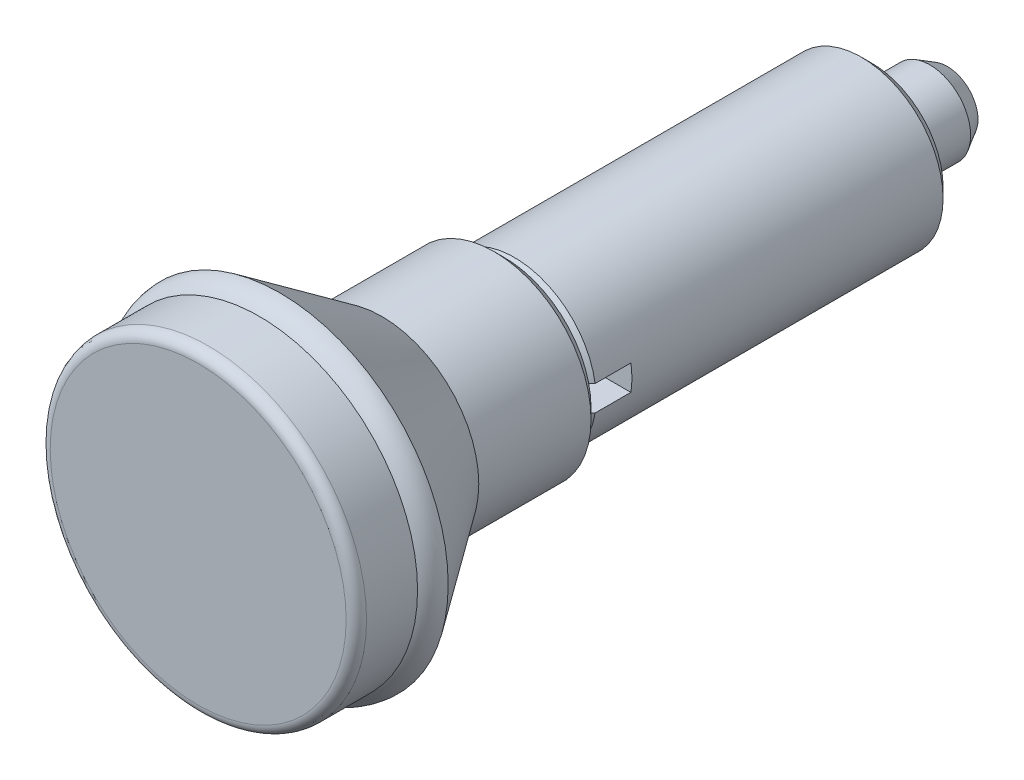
ISO-10303-21;
HEADER;
FILE_DESCRIPTION(('STEP AP214'),'2;1');
FILE_NAME('part.step','',(''),(''),'','','');
FILE_SCHEMA(('AUTOMOTIVE_DESIGN { 1 0 10303 214 1 1 1 1 }'));
ENDSEC;
DATA;
#1=APPLICATION_CONTEXT('core data for automotive mechanical design processes');
#2=APPLICATION_PROTOCOL_DEFINITION('international standard','automotive_design',2000,#1);
#3=PRODUCT_CONTEXT('',#1,'mechanical');
#4=PRODUCT('Part','Part','',(#3));
#5=PRODUCT_RELATED_PRODUCT_CATEGORY('part','',(#4));
#6=PRODUCT_DEFINITION_FORMATION('','',#4);
#7=PRODUCT_DEFINITION_CONTEXT('part definition',#1,'design');
#8=PRODUCT_DEFINITION('design','',#6,#7);
#9=PRODUCT_DEFINITION_SHAPE('','',#8);
#10=(LENGTH_UNIT() NAMED_UNIT(*) SI_UNIT(.MILLI.,.METRE.));
#11=(NAMED_UNIT(*) PLANE_ANGLE_UNIT() SI_UNIT($,.RADIAN.));
#12=(NAMED_UNIT(*) SI_UNIT($,.STERADIAN.) SOLID_ANGLE_UNIT());
#13=UNCERTAINTY_MEASURE_WITH_UNIT(LENGTH_MEASURE(1.E-05),#10,'distance_accuracy_value','');
#14=(GEOMETRIC_REPRESENTATION_CONTEXT(3) GLOBAL_UNCERTAINTY_ASSIGNED_CONTEXT((#13)) GLOBAL_UNIT_ASSIGNED_CONTEXT((#10,
#11,#12)) REPRESENTATION_CONTEXT('',''));
#15=CARTESIAN_POINT('',(0.,0.,0.));
#16=DIRECTION('',(0.,0.,1.));
#17=DIRECTION('',(1.,0.,0.));
#18=AXIS2_PLACEMENT_3D('',#15,#16,#17);
#19=CARTESIAN_POINT('',(0.,0.,36.));
#20=DIRECTION('',(0.,0.,-1.));
#21=DIRECTION('',(-1.,0.,0.));
#22=AXIS2_PLACEMENT_3D('',#19,#20,#21);
#23=CONICAL_SURFACE('',#22,6.99999999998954,0.785398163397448);
#24=CARTESIAN_POINT('',(0.,0.,36.));
#25=DIRECTION('',(0.,0.,1.));
#26=DIRECTION('',(1.,0.,0.));
#27=AXIS2_PLACEMENT_3D('',#24,#25,#26);
#28=CIRCLE('',#27,6.99999999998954);
#29=CARTESIAN_POINT('',(6.88748865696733,1.25,36.));
#30=VERTEX_POINT('',#29);
#31=CARTESIAN_POINT('',(-6.88748865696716,1.25,36.));
#32=VERTEX_POINT('',#31);
#33=EDGE_CURVE('E241',#30,#32,#28,.T.);
#34=ORIENTED_EDGE('',*,*,#33,.F.);
#35=CARTESIAN_POINT('',(3.07331867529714,1.25,39.682201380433));
#36=CARTESIAN_POINT('',(3.19215184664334,1.25,39.5720971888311));
#37=CARTESIAN_POINT('',(3.31056002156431,1.25,39.4615369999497));
#38=CARTESIAN_POINT('',(3.54669771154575,1.25,39.2396971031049));
#39=CARTESIAN_POINT('',(3.66442723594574,1.25,39.1284174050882));
#40=CARTESIAN_POINT('',(3.89937834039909,1.25,38.9053316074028));
#41=CARTESIAN_POINT('',(4.01659993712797,1.25,38.7935255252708));
#42=CARTESIAN_POINT('',(4.2506463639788,1.25,38.5694980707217));
#43=CARTESIAN_POINT('',(4.36747119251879,1.25,38.4572766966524));
#44=CARTESIAN_POINT('',(4.71746563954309,1.25,38.1201402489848));
#45=CARTESIAN_POINT('',(4.95016821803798,1.25,37.8947404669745));
#46=CARTESIAN_POINT('',(5.41475719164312,1.25,37.4430984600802));
#47=CARTESIAN_POINT('',(5.64664357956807,1.25,37.2168562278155));
#48=CARTESIAN_POINT('',(6.01467226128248,1.25,36.8568750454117));
#49=CARTESIAN_POINT('',(6.15100183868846,1.25,36.7233274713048));
#50=CARTESIAN_POINT('',(6.42349568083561,1.25,36.4560645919));
#51=CARTESIAN_POINT('',(6.5596599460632,1.25,36.3223492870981));
#52=CARTESIAN_POINT('',(6.96795284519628,1.25,35.9209914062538));
#53=CARTESIAN_POINT('',(7.23987726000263,1.25,35.6531410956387));
#54=CARTESIAN_POINT('',(7.87810226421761,1.25,35.0235739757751));
#55=CARTESIAN_POINT('',(8.24424504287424,1.25,34.6616972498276));
#56=CARTESIAN_POINT('',(8.97606193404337,1.25,33.9374702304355));
#57=CARTESIAN_POINT('',(9.34173604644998,1.25,33.5751199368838));
#58=CARTESIAN_POINT('',(10.0727396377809,1.25,32.8501037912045));
#59=CARTESIAN_POINT('',(10.4380691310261,1.25,32.4874379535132));
#60=CARTESIAN_POINT('',(11.1684822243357,1.25,31.7618594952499));
#61=CARTESIAN_POINT('',(11.533565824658,1.25,31.3989468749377));
#62=CARTESIAN_POINT('',(11.8985682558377,1.25,31.0359527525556));
#63=B_SPLINE_CURVE_WITH_KNOTS('',3,(#35,#36,#37,#38,#39,#40,#41,#42,#43,#44,#45,#46,#47,#48,#49,
#50,#51,#52,#53,#54,#55,#56,#57,#58,#59,#60,#61,#62),.UNSPECIFIED.,.F.,.F.,(4,2,2,2,2,2,2,2,2,2,
2,2,2,4),(0.,0.485998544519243,0.97199038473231,1.45796614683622,1.94394384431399,
2.91584538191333,3.88775545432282,4.46028161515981,5.03280608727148,6.17787317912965,
7.7222616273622,9.26665042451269,10.810971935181,12.3552918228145),.UNSPECIFIED.);
#64=CARTESIAN_POINT('',(7.9017403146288,1.25,35.));
#65=VERTEX_POINT('',#64);
#66=EDGE_CURVE('E151',#30,#65,#63,.T.);
#67=ORIENTED_EDGE('',*,*,#66,.T.);
#68=CARTESIAN_POINT('',(0.,0.,35.));
#69=DIRECTION('',(0.,0.,1.));
#70=DIRECTION('',(1.,0.,0.));
#71=AXIS2_PLACEMENT_3D('',#68,#69,#70);
#72=CIRCLE('',#71,7.99999999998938);
#73=CARTESIAN_POINT('',(-7.9017403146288,1.25,35.));
#74=VERTEX_POINT('',#73);
#75=EDGE_CURVE('E249',#65,#74,#72,.T.);
#76=ORIENTED_EDGE('',*,*,#75,.T.);
#77=CARTESIAN_POINT('',(-11.5196395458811,1.25,31.4127399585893));
#78=CARTESIAN_POINT('',(-11.1545497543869,1.25,31.7756867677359));
#79=CARTESIAN_POINT('',(-10.7893712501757,1.25,32.1385444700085));
#80=CARTESIAN_POINT('',(-10.0587444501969,1.25,32.863981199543));
#81=CARTESIAN_POINT('',(-9.69329615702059,1.25,33.226560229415));
#82=CARTESIAN_POINT('',(-8.9620504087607,1.25,33.9513263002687));
#83=CARTESIAN_POINT('',(-8.59625297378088,1.25,34.3135133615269));
#84=CARTESIAN_POINT('',(-7.86411782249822,1.25,35.0373483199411));
#85=CARTESIAN_POINT('',(-7.4977801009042,1.25,35.3989962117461));
#86=CARTESIAN_POINT('',(-6.764263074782,1.25,36.1215053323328));
#87=CARTESIAN_POINT('',(-6.39708369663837,1.25,36.4823664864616));
#88=CARTESIAN_POINT('',(-5.84532051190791,1.25,37.0226340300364));
#89=CARTESIAN_POINT('',(-5.66123606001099,1.25,37.2025502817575));
#90=CARTESIAN_POINT('',(-5.2926204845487,1.25,37.5619268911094));
#91=CARTESIAN_POINT('',(-5.10808935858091,1.25,37.7413872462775));
#92=CARTESIAN_POINT('',(-4.73840665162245,1.25,38.0997012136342));
#93=CARTESIAN_POINT('',(-4.55325501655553,1.25,38.2785547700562));
#94=CARTESIAN_POINT('',(-4.18210822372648,1.25,38.6353805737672));
#95=CARTESIAN_POINT('',(-3.99611307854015,1.25,38.8133528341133));
#96=CARTESIAN_POINT('',(-3.71617558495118,1.25,39.0793337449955));
#97=CARTESIAN_POINT('',(-3.6227014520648,1.25,39.1678350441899));
#98=CARTESIAN_POINT('',(-3.43536325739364,1.25,39.3444231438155));
#99=CARTESIAN_POINT('',(-3.3414991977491,1.25,39.4325099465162));
#100=CARTESIAN_POINT('',(-3.15328039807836,1.25,39.6081681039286));
#101=CARTESIAN_POINT('',(-3.05892563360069,1.25,39.695739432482));
#102=CARTESIAN_POINT('',(-2.86958085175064,1.25,39.8701958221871));
#103=CARTESIAN_POINT('',(-2.77459082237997,1.25,39.9570808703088));
#104=CARTESIAN_POINT('',(-2.679210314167,1.25,40.043537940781));
#105=B_SPLINE_CURVE_WITH_KNOTS('',3,(#77,#78,#79,#80,#81,#82,#83,#84,#85,#86,#87,#88,#89,#90,
#91,#92,#93,#94,#95,#96,#97,#98,#99,#100,#101,#102,#103,#104),.UNSPECIFIED.,.F.,.F.,(4,2,2,2,2,
2,2,2,2,2,2,2,2,4),(0.,1.54440566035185,3.08879667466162,4.63310356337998,6.17742567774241,
7.72188845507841,8.49410063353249,9.26631697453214,10.0386024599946,10.8108764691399,
11.1970477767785,11.5832169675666,11.9694055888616,12.3556015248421),.UNSPECIFIED.);
#106=EDGE_CURVE('E178',#74,#32,#105,.T.);
#107=ORIENTED_EDGE('',*,*,#106,.T.);
#108=EDGE_LOOP('',(#34,#67,#76,#107));
#109=FACE_BOUND('',#108,.T.);
#110=ADVANCED_FACE('F14',(#109),#23,.T.);
#111=CARTESIAN_POINT('',(-7.9017403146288,-1.25,35.));
#112=VERTEX_POINT('',#111);
#113=CARTESIAN_POINT('',(7.9017403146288,-1.25,35.));
#114=VERTEX_POINT('',#113);
#115=EDGE_CURVE('E245',#112,#114,#72,.T.);
#116=ORIENTED_EDGE('',*,*,#115,.T.);
#117=CARTESIAN_POINT('',(11.8985682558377,-1.25,31.0359527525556));
#118=CARTESIAN_POINT('',(11.5335502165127,-1.25,31.3989626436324));
#119=CARTESIAN_POINT('',(11.1684508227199,-1.25,31.7618908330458));
#120=CARTESIAN_POINT('',(10.4380084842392,-1.25,32.4874980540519));
#121=CARTESIAN_POINT('',(10.072665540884,-1.25,32.8501770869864));
#122=CARTESIAN_POINT('',(9.34166442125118,-1.25,33.5751911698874));
#123=CARTESIAN_POINT('',(8.97600625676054,-1.25,33.9375262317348));
#124=CARTESIAN_POINT('',(8.24421765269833,-1.25,34.6617234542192));
#125=CARTESIAN_POINT('',(7.87808721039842,-1.25,35.0235856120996));
#126=CARTESIAN_POINT('',(7.14510976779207,-1.25,35.7466262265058));
#127=CARTESIAN_POINT('',(6.77826272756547,-1.25,36.107804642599));
#128=CARTESIAN_POINT('',(6.22715843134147,-1.25,36.6487177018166));
#129=CARTESIAN_POINT('',(6.0433193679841,-1.25,36.8288783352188));
#130=CARTESIAN_POINT('',(5.67527392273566,-1.25,37.1888251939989));
#131=CARTESIAN_POINT('',(5.49106753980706,-1.25,37.3686114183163));
#132=CARTESIAN_POINT('',(5.12215804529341,-1.25,37.7276939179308));
#133=CARTESIAN_POINT('',(4.93745490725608,-1.25,37.906990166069));
#134=CARTESIAN_POINT('',(4.56738195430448,-1.25,38.26489079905));
#135=CARTESIAN_POINT('',(4.3820121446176,-1.25,38.4434951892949));
#136=CARTESIAN_POINT('',(4.01031623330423,-1.25,38.7997259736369));
#137=CARTESIAN_POINT('',(3.82399008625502,-1.25,38.9773523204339));
#138=CARTESIAN_POINT('',(3.54343589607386,-1.25,39.2426713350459));
#139=CARTESIAN_POINT('',(3.449739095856,-1.25,39.3309254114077));
#140=CARTESIAN_POINT('',(3.26189270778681,-1.25,39.5069518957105));
#141=CARTESIAN_POINT('',(3.16774311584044,-1.25,39.5947242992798));
#142=CARTESIAN_POINT('',(3.07331867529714,-1.25,39.682201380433));
#143=B_SPLINE_CURVE_WITH_KNOTS('',3,(#117,#118,#119,#120,#121,#122,#123,#124,#125,#126,#127,
#128,#129,#130,#131,#132,#133,#134,#135,#136,#137,#138,#139,#140,#141,#142),.UNSPECIFIED.,.F.,
.F.,(4,2,2,2,2,2,2,2,2,2,2,2,4),(0.,1.54438642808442,3.08876447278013,4.63308707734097,
6.17741864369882,7.72183884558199,8.4940378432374,9.26623902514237,10.0384821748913,
10.8107192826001,11.5829934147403,11.9691406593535,12.3552914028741),.UNSPECIFIED.);
#144=CARTESIAN_POINT('',(6.88748865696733,-1.25,36.));
#145=VERTEX_POINT('',#144);
#146=EDGE_CURVE('E126',#114,#145,#143,.T.);
#147=ORIENTED_EDGE('',*,*,#146,.T.);
#148=CARTESIAN_POINT('',(-6.88748865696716,-1.25,36.));
#149=VERTEX_POINT('',#148);
#150=EDGE_CURVE('E99',#149,#145,#28,.T.);
#151=ORIENTED_EDGE('',*,*,#150,.F.);
#152=CARTESIAN_POINT('',(-2.679210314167,-1.25,40.043537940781));
#153=CARTESIAN_POINT('',(-2.7861810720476,-1.25,39.9465667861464));
#154=CARTESIAN_POINT('',(-2.89266590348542,-1.25,39.8490636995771));
#155=CARTESIAN_POINT('',(-3.10485922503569,-1.25,39.6532207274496));
#156=CARTESIAN_POINT('',(-3.21056773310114,-1.25,39.5548808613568));
#157=CARTESIAN_POINT('',(-3.4214029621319,-1.25,39.3575923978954));
#158=CARTESIAN_POINT('',(-3.52652971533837,-1.25,39.2586438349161));
#159=CARTESIAN_POINT('',(-3.7363303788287,-1.25,39.0602666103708));
#160=CARTESIAN_POINT('',(-3.8410042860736,-1.25,38.9608379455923));
#161=CARTESIAN_POINT('',(-4.15447359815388,-1.25,38.662011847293));
#162=CARTESIAN_POINT('',(-4.36273628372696,-1.25,38.4620558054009));
#163=CARTESIAN_POINT('',(-4.77833253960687,-1.25,38.0611757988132));
#164=CARTESIAN_POINT('',(-4.98566609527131,-1.25,37.8602518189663));
#165=CARTESIAN_POINT('',(-5.35479555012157,-1.25,37.5013726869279));
#166=CARTESIAN_POINT('',(-5.51671750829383,-1.25,37.3435471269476));
#167=CARTESIAN_POINT('',(-5.84024989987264,-1.25,37.0275789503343));
#168=CARTESIAN_POINT('',(-6.00186033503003,-1.25,36.8694363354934));
#169=CARTESIAN_POINT('',(-6.48633985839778,-1.25,36.3946269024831));
#170=CARTESIAN_POINT('',(-6.80884578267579,-1.25,36.0775895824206));
#171=CARTESIAN_POINT('',(-7.49780540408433,-1.25,35.3989736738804));
#172=CARTESIAN_POINT('',(-7.86416638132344,-1.25,35.0373010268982));
#173=CARTESIAN_POINT('',(-8.59635268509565,-1.25,34.3134140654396));
#174=CARTESIAN_POINT('',(-8.96217801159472,-1.25,33.9511997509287));
#175=CARTESIAN_POINT('',(-9.69342759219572,-1.25,33.2264300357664));
#176=CARTESIAN_POINT('',(-10.0588518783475,-1.25,32.863874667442));
#177=CARTESIAN_POINT('',(-10.7894268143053,-1.25,32.1384891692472));
#178=CARTESIAN_POINT('',(-11.1545774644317,-1.25,31.7756590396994));
#179=CARTESIAN_POINT('',(-11.5196395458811,-1.25,31.4127399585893));
#180=B_SPLINE_CURVE_WITH_KNOTS('',3,(#152,#153,#154,#155,#156,#157,#158,#159,#160,#161,#162,
#163,#164,#165,#166,#167,#168,#169,#170,#171,#172,#173,#174,#175,#176,#177,#178,#179),
.UNSPECIFIED.,.F.,.F.,(4,2,2,2,2,2,2,2,2,2,2,2,2,4),(0.,0.433140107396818,0.866270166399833,
1.2993759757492,1.73248468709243,2.59862104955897,3.46477101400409,4.14311305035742,
4.82145126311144,6.17817535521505,7.72259916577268,9.26702307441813,10.8113129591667,
12.3556010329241),.UNSPECIFIED.);
#181=EDGE_CURVE('E185',#149,#112,#180,.T.);
#182=ORIENTED_EDGE('',*,*,#181,.T.);
#183=EDGE_LOOP('',(#116,#147,#151,#182));
#184=FACE_BOUND('',#183,.T.);
#185=ADVANCED_FACE('F222',(#184),#23,.T.);
#186=CARTESIAN_POINT('',(0.,0.,65.9999999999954));
#187=DIRECTION('',(0.,0.,1.));
#188=DIRECTION('',(1.,0.,0.));
#189=AXIS2_PLACEMENT_3D('',#186,#187,#188);
#190=CYLINDRICAL_SURFACE('',#189,7.99999999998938);
#191=CARTESIAN_POINT('',(0.,0.,1.));
#192=DIRECTION('',(0.,0.,1.));
#193=DIRECTION('',(1.,0.,0.));
#194=AXIS2_PLACEMENT_3D('',#191,#192,#193);
#195=CIRCLE('',#194,7.99999999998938);
#196=CARTESIAN_POINT('',(7.99999999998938,0.,1.));
#197=VERTEX_POINT('',#196);
#198=EDGE_CURVE('E294',#197,#197,#195,.T.);
#199=ORIENTED_EDGE('',*,*,#198,.T.);
#200=EDGE_LOOP('',(#199));
#201=FACE_BOUND('',#200,.T.);
#202=ORIENTED_EDGE('',*,*,#75,.F.);
#203=DIRECTION('',(0.,0.,1.));
#204=VECTOR('',#203,1.);
#205=CARTESIAN_POINT('',(7.9017403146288,1.25,65.9999999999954));
#206=LINE('',#205,#204);
#207=CARTESIAN_POINT('',(7.9017403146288,1.25,31.5));
#208=VERTEX_POINT('',#207);
#209=EDGE_CURVE('E134',#65,#208,#206,.F.);
#210=ORIENTED_EDGE('',*,*,#209,.T.);
#211=CARTESIAN_POINT('',(0.,0.,31.5));
#212=DIRECTION('',(0.,0.,-1.));
#213=DIRECTION('',(-1.,0.,0.));
#214=AXIS2_PLACEMENT_3D('',#211,#212,#213);
#215=CIRCLE('',#214,7.99999999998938);
#216=CARTESIAN_POINT('',(7.9017403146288,-1.25,31.5));
#217=VERTEX_POINT('',#216);
#218=EDGE_CURVE('E9',#217,#208,#215,.F.);
#219=ORIENTED_EDGE('',*,*,#218,.F.);
#220=DIRECTION('',(0.,0.,1.));
#221=VECTOR('',#220,1.);
#222=CARTESIAN_POINT('',(7.9017403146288,-1.25,65.9999999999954));
#223=LINE('',#222,#221);
#224=EDGE_CURVE('E108',#217,#114,#223,.T.);
#225=ORIENTED_EDGE('',*,*,#224,.T.);
#226=ORIENTED_EDGE('',*,*,#115,.F.);
#227=DIRECTION('',(0.,0.,1.));
#228=VECTOR('',#227,1.);
#229=CARTESIAN_POINT('',(-7.9017403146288,-1.25,65.9999999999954));
#230=LINE('',#229,#228);
#231=CARTESIAN_POINT('',(-7.9017403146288,-1.25,31.5));
#232=VERTEX_POINT('',#231);
#233=EDGE_CURVE('E22',#112,#232,#230,.F.);
#234=ORIENTED_EDGE('',*,*,#233,.T.);
#235=CARTESIAN_POINT('',(0.,0.,31.5));
#236=DIRECTION('',(0.,0.,-1.));
#237=DIRECTION('',(-1.,0.,0.));
#238=AXIS2_PLACEMENT_3D('',#235,#236,#237);
#239=CIRCLE('',#238,7.99999999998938);
#240=CARTESIAN_POINT('',(-7.9017403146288,1.25,31.5));
#241=VERTEX_POINT('',#240);
#242=EDGE_CURVE('E273',#241,#232,#239,.F.);
#243=ORIENTED_EDGE('',*,*,#242,.F.);
#244=DIRECTION('',(0.,0.,1.));
#245=VECTOR('',#244,1.);
#246=CARTESIAN_POINT('',(-7.9017403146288,1.25,65.9999999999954));
#247=LINE('',#246,#245);
#248=EDGE_CURVE('E275',#241,#74,#247,.T.);
#249=ORIENTED_EDGE('',*,*,#248,.T.);
#250=EDGE_LOOP('',(#202,#210,#219,#225,#226,#234,#243,#249));
#251=FACE_BOUND('',#250,.T.);
#252=ADVANCED_FACE('F220',(#201,#251),#190,.T.);
#253=CARTESIAN_POINT('',(0.,0.,1.25094379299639E-10));
#254=DIRECTION('',(0.,0.,1.));
#255=DIRECTION('',(0.,1.,0.));
#256=AXIS2_PLACEMENT_3D('',#253,#254,#255);
#257=SPHERICAL_SURFACE('',#256,8.);
#258=CARTESIAN_POINT('',(0.,0.,-7.4113534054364));
#259=DIRECTION('',(0.,0.,1.));
#260=DIRECTION('',(1.,0.,0.));
#261=AXIS2_PLACEMENT_3D('',#258,#259,#260);
#262=CIRCLE('',#261,3.01194965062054);
#263=CARTESIAN_POINT('',(3.01194965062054,0.,-7.4113534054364));
#264=VERTEX_POINT('',#263);
#265=EDGE_CURVE('E282',#264,#264,#262,.T.);
#266=ORIENTED_EDGE('',*,*,#265,.F.);
#267=EDGE_LOOP('',(#266));
#268=FACE_BOUND('',#267,.T.);
#269=ADVANCED_FACE('F16',(#268),#257,.T.);
#270=CARTESIAN_POINT('',(0.,0.,65.9999999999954));
#271=DIRECTION('',(0.,0.,1.));
#272=DIRECTION('',(1.,0.,0.));
#273=AXIS2_PLACEMENT_3D('',#270,#271,#272);
#274=PLANE('',#273);
#275=CARTESIAN_POINT('',(0.,0.,65.9999999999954));
#276=DIRECTION('',(0.,0.,1.));
#277=DIRECTION('',(1.,0.,0.));
#278=AXIS2_PLACEMENT_3D('',#275,#276,#277);
#279=CIRCLE('',#278,14.5);
#280=CARTESIAN_POINT('',(14.5,0.,65.9999999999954));
#281=VERTEX_POINT('',#280);
#282=EDGE_CURVE('E270',#281,#281,#279,.T.);
#283=ORIENTED_EDGE('',*,*,#282,.T.);
#284=EDGE_LOOP('',(#283));
#285=FACE_BOUND('',#284,.T.);
#286=ADVANCED_FACE('F230',(#285),#274,.T.);
#287=CARTESIAN_POINT('',(0.,0.,64.9999999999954));
#288=DIRECTION('',(0.,0.,1.));
#289=DIRECTION('',(1.,0.,0.));
#290=AXIS2_PLACEMENT_3D('',#287,#288,#289);
#291=TOROIDAL_SURFACE('',#290,14.5000000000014,1.);
#292=CARTESIAN_POINT('',(0.,0.,64.9999999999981));
#293=DIRECTION('',(0.,0.,1.));
#294=DIRECTION('',(1.,0.,0.));
#295=AXIS2_PLACEMENT_3D('',#292,#293,#294);
#296=CIRCLE('',#295,15.5000000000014);
#297=CARTESIAN_POINT('',(15.5000000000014,0.,64.9999999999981));
#298=VERTEX_POINT('',#297);
#299=EDGE_CURVE('E267',#298,#298,#296,.T.);
#300=ORIENTED_EDGE('',*,*,#299,.T.);
#301=EDGE_LOOP('',(#300));
#302=FACE_BOUND('',#301,.T.);
#303=ORIENTED_EDGE('',*,*,#282,.F.);
#304=EDGE_LOOP('',(#303));
#305=FACE_BOUND('',#304,.T.);
#306=ADVANCED_FACE('F392',(#302,#305),#291,.T.);
#307=CARTESIAN_POINT('',(0.,0.,65.9999999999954));
#308=DIRECTION('',(0.,0.,1.));
#309=DIRECTION('',(1.,0.,0.));
#310=AXIS2_PLACEMENT_3D('',#307,#308,#309);
#311=CYLINDRICAL_SURFACE('',#310,15.5000000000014);
#312=CARTESIAN_POINT('',(0.,0.,59.9999999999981));
#313=DIRECTION('',(0.,0.,1.));
#314=DIRECTION('',(1.,0.,0.));
#315=AXIS2_PLACEMENT_3D('',#312,#313,#314);
#316=CIRCLE('',#315,15.5000000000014);
#317=CARTESIAN_POINT('',(15.5000000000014,0.,59.9999999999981));
#318=VERTEX_POINT('',#317);
#319=EDGE_CURVE('E264',#318,#318,#316,.T.);
#320=ORIENTED_EDGE('',*,*,#319,.T.);
#321=EDGE_LOOP('',(#320));
#322=FACE_BOUND('',#321,.T.);
#323=ORIENTED_EDGE('',*,*,#299,.F.);
#324=EDGE_LOOP('',(#323));
#325=FACE_BOUND('',#324,.T.);
#326=ADVANCED_FACE('F382',(#322,#325),#311,.T.);
#327=CARTESIAN_POINT('',(0.,0.,58.000000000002));
#328=DIRECTION('',(0.,0.,1.));
#329=DIRECTION('',(1.,0.,0.));
#330=AXIS2_PLACEMENT_3D('',#327,#328,#329);
#331=TOROIDAL_SURFACE('',#330,14.0000000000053,2.49999999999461);
#332=CARTESIAN_POINT('',(0.,0.,58.));
#333=DIRECTION('',(0.,0.,1.));
#334=DIRECTION('',(1.,0.,0.));
#335=AXIS2_PLACEMENT_3D('',#332,#333,#334);
#336=CIRCLE('',#335,16.5);
#337=CARTESIAN_POINT('',(16.5,0.,58.));
#338=VERTEX_POINT('',#337);
#339=EDGE_CURVE('E261',#338,#338,#336,.T.);
#340=ORIENTED_EDGE('',*,*,#339,.T.);
#341=EDGE_LOOP('',(#340));
#342=FACE_BOUND('',#341,.T.);
#343=ORIENTED_EDGE('',*,*,#319,.F.);
#344=EDGE_LOOP('',(#343));
#345=FACE_BOUND('',#344,.T.);
#346=ADVANCED_FACE('F372',(#342,#345),#331,.T.);
#347=CARTESIAN_POINT('',(0.,0.,58.));
#348=DIRECTION('',(0.,0.,1.));
#349=DIRECTION('',(1.,0.,0.));
#350=AXIS2_PLACEMENT_3D('',#347,#348,#349);
#351=CONICAL_SURFACE('',#350,16.5,0.610725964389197);
#352=CARTESIAN_POINT('',(0.,0.,48.));
#353=DIRECTION('',(0.,0.,1.));
#354=DIRECTION('',(1.,0.,0.));
#355=AXIS2_PLACEMENT_3D('',#352,#353,#354);
#356=CIRCLE('',#355,9.5);
#357=CARTESIAN_POINT('',(9.5,0.,48.));
#358=VERTEX_POINT('',#357);
#359=EDGE_CURVE('E258',#358,#358,#356,.T.);
#360=ORIENTED_EDGE('',*,*,#359,.T.);
#361=EDGE_LOOP('',(#360));
#362=FACE_BOUND('',#361,.T.);
#363=ORIENTED_EDGE('',*,*,#339,.F.);
#364=EDGE_LOOP('',(#363));
#365=FACE_BOUND('',#364,.T.);
#366=ADVANCED_FACE('F362',(#362,#365),#351,.T.);
#367=CARTESIAN_POINT('',(0.,0.,65.9999999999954));
#368=DIRECTION('',(0.,0.,1.));
#369=DIRECTION('',(1.,0.,0.));
#370=AXIS2_PLACEMENT_3D('',#367,#368,#369);
#371=CYLINDRICAL_SURFACE('',#370,9.5);
#372=CARTESIAN_POINT('',(0.,0.,37.));
#373=DIRECTION('',(0.,0.,1.));
#374=DIRECTION('',(1.,0.,0.));
#375=AXIS2_PLACEMENT_3D('',#372,#373,#374);
#376=CIRCLE('',#375,9.5);
#377=CARTESIAN_POINT('',(9.5,0.,37.));
#378=VERTEX_POINT('',#377);
#379=EDGE_CURVE('E255',#378,#378,#376,.T.);
#380=ORIENTED_EDGE('',*,*,#379,.T.);
#381=EDGE_LOOP('',(#380));
#382=FACE_BOUND('',#381,.T.);
#383=ORIENTED_EDGE('',*,*,#359,.F.);
#384=EDGE_LOOP('',(#383));
#385=FACE_BOUND('',#384,.T.);
#386=ADVANCED_FACE('F352',(#382,#385),#371,.T.);
#387=CARTESIAN_POINT('',(0.,0.,37.));
#388=DIRECTION('',(0.,0.,1.));
#389=DIRECTION('',(1.,0.,0.));
#390=AXIS2_PLACEMENT_3D('',#387,#388,#389);
#391=CONICAL_SURFACE('',#390,9.5,0.785398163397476);
#392=CARTESIAN_POINT('',(0.,0.,36.));
#393=DIRECTION('',(0.,0.,1.));
#394=DIRECTION('',(1.,0.,0.));
#395=AXIS2_PLACEMENT_3D('',#392,#393,#394);
#396=CIRCLE('',#395,8.49999999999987);
#397=CARTESIAN_POINT('',(8.49999999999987,0.,36.));
#398=VERTEX_POINT('',#397);
#399=EDGE_CURVE('E247',#398,#398,#396,.T.);
#400=ORIENTED_EDGE('',*,*,#399,.T.);
#401=EDGE_LOOP('',(#400));
#402=FACE_BOUND('',#401,.T.);
#403=ORIENTED_EDGE('',*,*,#379,.F.);
#404=EDGE_LOOP('',(#403));
#405=FACE_BOUND('',#404,.T.);
#406=ADVANCED_FACE('F343',(#402,#405),#391,.T.);
#407=CARTESIAN_POINT('',(0.,8.49999999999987,36.));
#408=DIRECTION('',(0.,0.,-1.));
#409=DIRECTION('',(-1.,0.,0.));
#410=AXIS2_PLACEMENT_3D('',#407,#408,#409);
#411=PLANE('',#410);
#412=ORIENTED_EDGE('',*,*,#150,.T.);
#413=DIRECTION('',(-1.,0.,0.));
#414=VECTOR('',#413,1.);
#415=CARTESIAN_POINT('',(5.,-1.25,36.));
#416=LINE('',#415,#414);
#417=CARTESIAN_POINT('',(5.,-1.25,36.));
#418=VERTEX_POINT('',#417);
#419=EDGE_CURVE('E89',#145,#418,#416,.T.);
#420=ORIENTED_EDGE('',*,*,#419,.T.);
#421=DIRECTION('',(0.,1.,0.));
#422=VECTOR('',#421,1.);
#423=CARTESIAN_POINT('',(5.,1.25,36.));
#424=LINE('',#423,#422);
#425=CARTESIAN_POINT('',(5.,1.25,36.));
#426=VERTEX_POINT('',#425);
#427=EDGE_CURVE('E95',#418,#426,#424,.T.);
#428=ORIENTED_EDGE('',*,*,#427,.T.);
#429=DIRECTION('',(1.,0.,0.));
#430=VECTOR('',#429,1.);
#431=CARTESIAN_POINT('',(5.,1.25,36.));
#432=LINE('',#431,#430);
#433=EDGE_CURVE('E102',#426,#30,#432,.T.);
#434=ORIENTED_EDGE('',*,*,#433,.T.);
#435=ORIENTED_EDGE('',*,*,#33,.T.);
#436=DIRECTION('',(1.,0.,0.));
#437=VECTOR('',#436,1.);
#438=CARTESIAN_POINT('',(-5.,1.25,36.));
#439=LINE('',#438,#437);
#440=CARTESIAN_POINT('',(-5.,1.25,36.));
#441=VERTEX_POINT('',#440);
#442=EDGE_CURVE('E163',#32,#441,#439,.T.);
#443=ORIENTED_EDGE('',*,*,#442,.T.);
#444=DIRECTION('',(0.,-1.,0.));
#445=VECTOR('',#444,1.);
#446=CARTESIAN_POINT('',(-5.,1.25,36.));
#447=LINE('',#446,#445);
#448=CARTESIAN_POINT('',(-5.,-1.25,36.));
#449=VERTEX_POINT('',#448);
#450=EDGE_CURVE('E158',#441,#449,#447,.T.);
#451=ORIENTED_EDGE('',*,*,#450,.T.);
#452=DIRECTION('',(-1.,0.,0.));
#453=VECTOR('',#452,1.);
#454=CARTESIAN_POINT('',(-5.,-1.25,36.));
#455=LINE('',#454,#453);
#456=EDGE_CURVE('E161',#449,#149,#455,.T.);
#457=ORIENTED_EDGE('',*,*,#456,.T.);
#458=EDGE_LOOP('',(#412,#420,#428,#434,#435,#443,#451,#457));
#459=FACE_BOUND('',#458,.T.);
#460=ORIENTED_EDGE('',*,*,#399,.F.);
#461=EDGE_LOOP('',(#460));
#462=FACE_BOUND('',#461,.T.);
#463=ADVANCED_FACE('F91',(#459,#462),#411,.T.);
#464=CARTESIAN_POINT('',(0.,0.,1.));
#465=DIRECTION('',(0.,0.,1.));
#466=DIRECTION('',(1.,0.,0.));
#467=AXIS2_PLACEMENT_3D('',#464,#465,#466);
#468=CONICAL_SURFACE('',#467,7.99999999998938,0.785398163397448);
#469=CARTESIAN_POINT('',(0.,0.,0.));
#470=DIRECTION('',(0.,0.,1.));
#471=DIRECTION('',(1.,0.,0.));
#472=AXIS2_PLACEMENT_3D('',#469,#470,#471);
#473=CIRCLE('',#472,6.99999999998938);
#474=CARTESIAN_POINT('',(6.99999999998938,0.,0.));
#475=VERTEX_POINT('',#474);
#476=EDGE_CURVE('E292',#475,#475,#473,.T.);
#477=ORIENTED_EDGE('',*,*,#476,.T.);
#478=EDGE_LOOP('',(#477));
#479=FACE_BOUND('',#478,.T.);
#480=ORIENTED_EDGE('',*,*,#198,.F.);
#481=EDGE_LOOP('',(#480));
#482=FACE_BOUND('',#481,.T.);
#483=ADVANCED_FACE('F216',(#479,#482),#468,.T.);
#484=CARTESIAN_POINT('',(0.,6.99999999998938,0.));
#485=DIRECTION('',(0.,0.,-1.));
#486=DIRECTION('',(-1.,0.,0.));
#487=AXIS2_PLACEMENT_3D('',#484,#485,#486);
#488=PLANE('',#487);
#489=CARTESIAN_POINT('',(0.,0.,0.));
#490=DIRECTION('',(0.,0.,1.));
#491=DIRECTION('',(1.,0.,0.));
#492=AXIS2_PLACEMENT_3D('',#489,#490,#491);
#493=CIRCLE('',#492,3.99999999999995);
#494=CARTESIAN_POINT('',(3.99999999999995,0.,0.));
#495=VERTEX_POINT('',#494);
#496=EDGE_CURVE('E287',#495,#495,#493,.T.);
#497=ORIENTED_EDGE('',*,*,#496,.T.);
#498=EDGE_LOOP('',(#497));
#499=FACE_BOUND('',#498,.T.);
#500=ORIENTED_EDGE('',*,*,#476,.F.);
#501=EDGE_LOOP('',(#500));
#502=FACE_BOUND('',#501,.T.);
#503=ADVANCED_FACE('F212',(#499,#502),#488,.T.);
#504=CARTESIAN_POINT('',(0.,0.,65.9999999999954));
#505=DIRECTION('',(0.,0.,1.));
#506=DIRECTION('',(1.,0.,0.));
#507=AXIS2_PLACEMENT_3D('',#504,#505,#506);
#508=CYLINDRICAL_SURFACE('',#507,3.99999999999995);
#509=CARTESIAN_POINT('',(0.,0.,-5.6999999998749));
#510=DIRECTION('',(0.,0.,1.));
#511=DIRECTION('',(1.,0.,0.));
#512=AXIS2_PLACEMENT_3D('',#509,#510,#511);
#513=CIRCLE('',#512,3.99999999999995);
#514=CARTESIAN_POINT('',(3.99999999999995,0.,-5.6999999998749));
#515=VERTEX_POINT('',#514);
#516=EDGE_CURVE('E284',#515,#515,#513,.T.);
#517=ORIENTED_EDGE('',*,*,#516,.T.);
#518=EDGE_LOOP('',(#517));
#519=FACE_BOUND('',#518,.T.);
#520=ORIENTED_EDGE('',*,*,#496,.F.);
#521=EDGE_LOOP('',(#520));
#522=FACE_BOUND('',#521,.T.);
#523=ADVANCED_FACE('F208',(#519,#522),#508,.T.);
#524=CARTESIAN_POINT('',(0.,0.,-5.6999999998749));
#525=DIRECTION('',(0.,0.,1.));
#526=DIRECTION('',(1.,0.,0.));
#527=AXIS2_PLACEMENT_3D('',#524,#525,#526);
#528=CONICAL_SURFACE('',#527,3.99999999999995,0.52359877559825);
#529=ORIENTED_EDGE('',*,*,#265,.T.);
#530=EDGE_LOOP('',(#529));
#531=FACE_BOUND('',#530,.T.);
#532=ORIENTED_EDGE('',*,*,#516,.F.);
#533=EDGE_LOOP('',(#532));
#534=FACE_BOUND('',#533,.T.);
#535=ADVANCED_FACE('F204',(#531,#534),#528,.T.);
#536=CARTESIAN_POINT('',(-5.,1.25,31.5));
#537=DIRECTION('',(-1.,0.,0.));
#538=DIRECTION('',(0.,0.,1.));
#539=AXIS2_PLACEMENT_3D('',#536,#537,#538);
#540=PLANE('',#539);
#541=ORIENTED_EDGE('',*,*,#450,.F.);
#542=DIRECTION('',(0.,0.,1.));
#543=VECTOR('',#542,1.);
#544=CARTESIAN_POINT('',(-5.,1.25,31.5));
#545=LINE('',#544,#543);
#546=CARTESIAN_POINT('',(-5.,1.25,31.5));
#547=VERTEX_POINT('',#546);
#548=EDGE_CURVE('E172',#547,#441,#545,.T.);
#549=ORIENTED_EDGE('',*,*,#548,.F.);
#550=DIRECTION('',(0.,-1.,0.));
#551=VECTOR('',#550,1.);
#552=CARTESIAN_POINT('',(-5.,1.25,31.5));
#553=LINE('',#552,#551);
#554=CARTESIAN_POINT('',(-5.,-1.25,31.5));
#555=VERTEX_POINT('',#554);
#556=EDGE_CURVE('E165',#547,#555,#553,.T.);
#557=ORIENTED_EDGE('',*,*,#556,.T.);
#558=DIRECTION('',(0.,0.,1.));
#559=VECTOR('',#558,1.);
#560=CARTESIAN_POINT('',(-5.,-1.25,31.5));
#561=LINE('',#560,#559);
#562=EDGE_CURVE('E175',#555,#449,#561,.T.);
#563=ORIENTED_EDGE('',*,*,#562,.T.);
#564=EDGE_LOOP('',(#541,#549,#557,#563));
#565=FACE_BOUND('',#564,.T.);
#566=ADVANCED_FACE('F200',(#565),#540,.T.);
#567=CARTESIAN_POINT('',(-5.,-1.25,31.5));
#568=DIRECTION('',(0.,1.,0.));
#569=DIRECTION('',(-1.,0.,0.));
#570=AXIS2_PLACEMENT_3D('',#567,#568,#569);
#571=PLANE('',#570);
#572=ORIENTED_EDGE('',*,*,#456,.F.);
#573=ORIENTED_EDGE('',*,*,#562,.F.);
#574=DIRECTION('',(-1.,0.,0.));
#575=VECTOR('',#574,1.);
#576=CARTESIAN_POINT('',(-5.,-1.25,31.5));
#577=LINE('',#576,#575);
#578=EDGE_CURVE('E168',#555,#232,#577,.T.);
#579=ORIENTED_EDGE('',*,*,#578,.T.);
#580=ORIENTED_EDGE('',*,*,#233,.F.);
#581=ORIENTED_EDGE('',*,*,#181,.F.);
#582=EDGE_LOOP('',(#572,#573,#579,#580,#581));
#583=FACE_BOUND('',#582,.T.);
#584=ADVANCED_FACE('F195',(#583),#571,.T.);
#585=CARTESIAN_POINT('',(-5.,1.25,31.5));
#586=DIRECTION('',(0.,-1.,0.));
#587=DIRECTION('',(1.,0.,0.));
#588=AXIS2_PLACEMENT_3D('',#585,#586,#587);
#589=PLANE('',#588);
#590=ORIENTED_EDGE('',*,*,#248,.F.);
#591=DIRECTION('',(1.,0.,0.));
#592=VECTOR('',#591,1.);
#593=CARTESIAN_POINT('',(-5.,1.25,31.5));
#594=LINE('',#593,#592);
#595=EDGE_CURVE('E36',#241,#547,#594,.T.);
#596=ORIENTED_EDGE('',*,*,#595,.T.);
#597=ORIENTED_EDGE('',*,*,#548,.T.);
#598=ORIENTED_EDGE('',*,*,#442,.F.);
#599=ORIENTED_EDGE('',*,*,#106,.F.);
#600=EDGE_LOOP('',(#590,#596,#597,#598,#599));
#601=FACE_BOUND('',#600,.T.);
#602=ADVANCED_FACE('F192',(#601),#589,.T.);
#603=CARTESIAN_POINT('',(-5.,-1.25,31.5));
#604=DIRECTION('',(0.,0.,-1.));
#605=DIRECTION('',(-1.,0.,0.));
#606=AXIS2_PLACEMENT_3D('',#603,#604,#605);
#607=PLANE('',#606);
#608=ORIENTED_EDGE('',*,*,#242,.T.);
#609=ORIENTED_EDGE('',*,*,#578,.F.);
#610=ORIENTED_EDGE('',*,*,#556,.F.);
#611=ORIENTED_EDGE('',*,*,#595,.F.);
#612=EDGE_LOOP('',(#608,#609,#610,#611));
#613=FACE_BOUND('',#612,.T.);
#614=ADVANCED_FACE('F148',(#613),#607,.F.);
#615=CARTESIAN_POINT('',(5.,1.25,31.5));
#616=DIRECTION('',(0.,-1.,0.));
#617=DIRECTION('',(1.,0.,0.));
#618=AXIS2_PLACEMENT_3D('',#615,#616,#617);
#619=PLANE('',#618);
#620=ORIENTED_EDGE('',*,*,#433,.F.);
#621=DIRECTION('',(0.,0.,1.));
#622=VECTOR('',#621,1.);
#623=CARTESIAN_POINT('',(5.,1.25,31.5));
#624=LINE('',#623,#622);
#625=CARTESIAN_POINT('',(5.,1.25,31.5));
#626=VERTEX_POINT('',#625);
#627=EDGE_CURVE('E109',#626,#426,#624,.T.);
#628=ORIENTED_EDGE('',*,*,#627,.F.);
#629=DIRECTION('',(1.,0.,0.));
#630=VECTOR('',#629,1.);
#631=CARTESIAN_POINT('',(5.,1.25,31.5));
#632=LINE('',#631,#630);
#633=EDGE_CURVE('E114',#626,#208,#632,.T.);
#634=ORIENTED_EDGE('',*,*,#633,.T.);
#635=ORIENTED_EDGE('',*,*,#209,.F.);
#636=ORIENTED_EDGE('',*,*,#66,.F.);
#637=EDGE_LOOP('',(#620,#628,#634,#635,#636));
#638=FACE_BOUND('',#637,.T.);
#639=ADVANCED_FACE('F143',(#638),#619,.T.);
#640=CARTESIAN_POINT('',(5.,-1.25,31.5));
#641=DIRECTION('',(0.,1.,0.));
#642=DIRECTION('',(-1.,0.,0.));
#643=AXIS2_PLACEMENT_3D('',#640,#641,#642);
#644=PLANE('',#643);
#645=ORIENTED_EDGE('',*,*,#224,.F.);
#646=DIRECTION('',(-1.,0.,0.));
#647=VECTOR('',#646,1.);
#648=CARTESIAN_POINT('',(5.,-1.25,31.5));
#649=LINE('',#648,#647);
#650=CARTESIAN_POINT('',(5.,-1.25,31.5));
#651=VERTEX_POINT('',#650);
#652=EDGE_CURVE('E28',#217,#651,#649,.T.);
#653=ORIENTED_EDGE('',*,*,#652,.T.);
#654=DIRECTION('',(0.,0.,1.));
#655=VECTOR('',#654,1.);
#656=CARTESIAN_POINT('',(5.,-1.25,31.5));
#657=LINE('',#656,#655);
#658=EDGE_CURVE('E105',#651,#418,#657,.T.);
#659=ORIENTED_EDGE('',*,*,#658,.T.);
#660=ORIENTED_EDGE('',*,*,#419,.F.);
#661=ORIENTED_EDGE('',*,*,#146,.F.);
#662=EDGE_LOOP('',(#645,#653,#659,#660,#661));
#663=FACE_BOUND('',#662,.T.);
#664=ADVANCED_FACE('F106',(#663),#644,.T.);
#665=CARTESIAN_POINT('',(5.,1.25,31.5));
#666=DIRECTION('',(1.,0.,0.));
#667=DIRECTION('',(0.,0.,-1.));
#668=AXIS2_PLACEMENT_3D('',#665,#666,#667);
#669=PLANE('',#668);
#670=ORIENTED_EDGE('',*,*,#427,.F.);
#671=ORIENTED_EDGE('',*,*,#658,.F.);
#672=DIRECTION('',(0.,1.,0.));
#673=VECTOR('',#672,1.);
#674=CARTESIAN_POINT('',(5.,1.25,31.5));
#675=LINE('',#674,#673);
#676=EDGE_CURVE('E121',#651,#626,#675,.T.);
#677=ORIENTED_EDGE('',*,*,#676,.T.);
#678=ORIENTED_EDGE('',*,*,#627,.T.);
#679=EDGE_LOOP('',(#670,#671,#677,#678));
#680=FACE_BOUND('',#679,.T.);
#681=ADVANCED_FACE('F111',(#680),#669,.T.);
#682=CARTESIAN_POINT('',(14.9482447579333,1.25,31.5));
#683=DIRECTION('',(0.,0.,-1.));
#684=DIRECTION('',(-1.,0.,0.));
#685=AXIS2_PLACEMENT_3D('',#682,#683,#684);
#686=PLANE('',#685);
#687=ORIENTED_EDGE('',*,*,#218,.T.);
#688=ORIENTED_EDGE('',*,*,#633,.F.);
#689=ORIENTED_EDGE('',*,*,#676,.F.);
#690=ORIENTED_EDGE('',*,*,#652,.F.);
#691=EDGE_LOOP('',(#687,#688,#689,#690));
#692=FACE_BOUND('',#691,.T.);
#693=ADVANCED_FACE('F326',(#692),#686,.F.);
#694=CLOSED_SHELL('',(#110,#185,#252,#269,#286,#306,#326,#346,#366,#386,#406,#463,#483,#503,
#523,#535,#566,#584,#602,#614,#639,#664,#681,#693));
#695=MANIFOLD_SOLID_BREP('B1',#694);
#696=ADVANCED_BREP_SHAPE_REPRESENTATION('',(#18,#695),#14);
#697=SHAPE_DEFINITION_REPRESENTATION(#9,#696);
ENDSEC;
END-ISO-10303-21;
